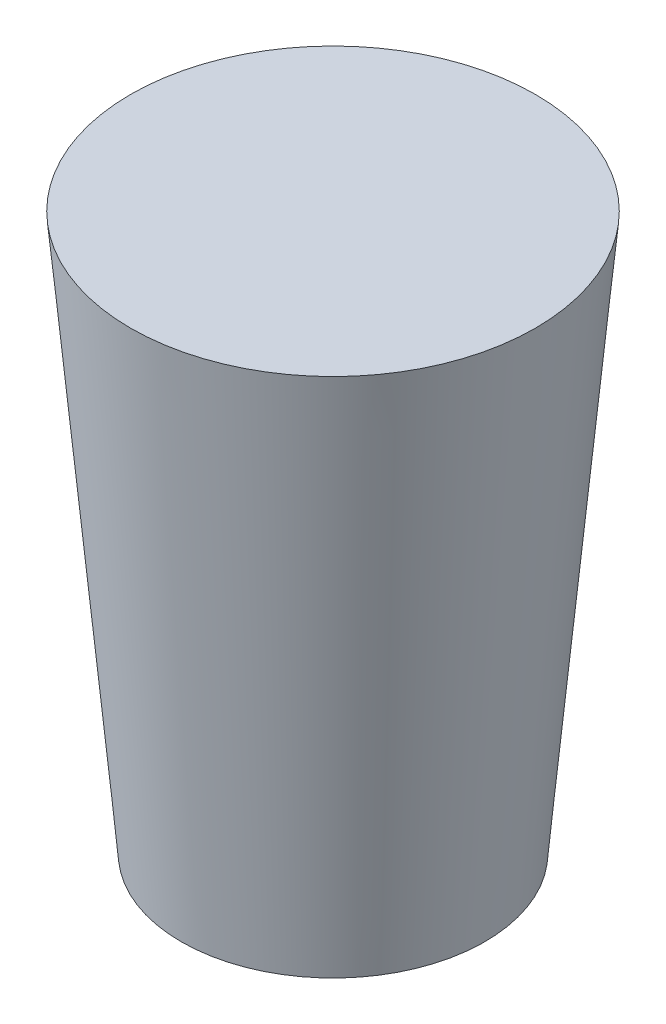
ISO-10303-21;
HEADER;
FILE_DESCRIPTION(('STEP AP214'),'2;1');
FILE_NAME('part.step','',(''),(''),'','','');
FILE_SCHEMA(('AUTOMOTIVE_DESIGN { 1 0 10303 214 1 1 1 1 }'));
ENDSEC;
DATA;
#1=APPLICATION_CONTEXT('core data for automotive mechanical design processes');
#2=APPLICATION_PROTOCOL_DEFINITION('international standard','automotive_design',2000,#1);
#3=PRODUCT_CONTEXT('',#1,'mechanical');
#4=PRODUCT('Part','Part','',(#3));
#5=PRODUCT_RELATED_PRODUCT_CATEGORY('part','',(#4));
#6=PRODUCT_DEFINITION_FORMATION('','',#4);
#7=PRODUCT_DEFINITION_CONTEXT('part definition',#1,'design');
#8=PRODUCT_DEFINITION('design','',#6,#7);
#9=PRODUCT_DEFINITION_SHAPE('','',#8);
#10=(LENGTH_UNIT() NAMED_UNIT(*) SI_UNIT(.MILLI.,.METRE.));
#11=(NAMED_UNIT(*) PLANE_ANGLE_UNIT() SI_UNIT($,.RADIAN.));
#12=(NAMED_UNIT(*) SI_UNIT($,.STERADIAN.) SOLID_ANGLE_UNIT());
#13=UNCERTAINTY_MEASURE_WITH_UNIT(LENGTH_MEASURE(1.E-05),#10,'distance_accuracy_value','');
#14=(GEOMETRIC_REPRESENTATION_CONTEXT(3) GLOBAL_UNCERTAINTY_ASSIGNED_CONTEXT((#13)) GLOBAL_UNIT_ASSIGNED_CONTEXT((#10,
#11,#12)) REPRESENTATION_CONTEXT('',''));
#15=CARTESIAN_POINT('',(0.,0.,0.));
#16=DIRECTION('',(0.,0.,1.));
#17=DIRECTION('',(1.,0.,0.));
#18=AXIS2_PLACEMENT_3D('',#15,#16,#17);
#19=CARTESIAN_POINT('',(-15.0396263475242,-25.3849168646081,0.));
#20=DIRECTION('',(0.,-1.,0.));
#21=DIRECTION('',(0.,0.,-1.));
#22=AXIS2_PLACEMENT_3D('',#19,#20,#21);
#23=PLANE('',#22);
#24=CARTESIAN_POINT('',(-15.0396263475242,-25.3849168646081,0.));
#25=DIRECTION('',(0.,1.,0.));
#26=DIRECTION('',(0.,0.,1.));
#27=AXIS2_PLACEMENT_3D('',#24,#25,#26);
#28=CIRCLE('',#27,8.99999999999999);
#29=CARTESIAN_POINT('',(-15.0396263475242,-25.3849168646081,8.99999999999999));
#30=VERTEX_POINT('',#29);
#31=EDGE_CURVE('E10',#30,#30,#28,.T.);
#32=ORIENTED_EDGE('',*,*,#31,.F.);
#33=EDGE_LOOP('',(#32));
#34=FACE_BOUND('',#33,.T.);
#35=ADVANCED_FACE('F29',(#34),#23,.T.);
#36=CARTESIAN_POINT('',(-15.0396263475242,7.61508313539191,0.));
#37=DIRECTION('',(0.,1.,0.));
#38=DIRECTION('',(0.,0.,1.));
#39=AXIS2_PLACEMENT_3D('',#36,#37,#38);
#40=CONICAL_SURFACE('',#39,12.,0.0906598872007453);
#41=ORIENTED_EDGE('',*,*,#31,.T.);
#42=EDGE_LOOP('',(#41));
#43=FACE_BOUND('',#42,.T.);
#44=CARTESIAN_POINT('',(-15.0396263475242,7.61508313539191,0.));
#45=DIRECTION('',(0.,1.,0.));
#46=DIRECTION('',(0.,0.,1.));
#47=AXIS2_PLACEMENT_3D('',#44,#45,#46);
#48=CIRCLE('',#47,12.);
#49=CARTESIAN_POINT('',(-15.0396263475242,7.61508313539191,12.));
#50=VERTEX_POINT('',#49);
#51=EDGE_CURVE('E35',#50,#50,#48,.T.);
#52=ORIENTED_EDGE('',*,*,#51,.F.);
#53=EDGE_LOOP('',(#52));
#54=FACE_BOUND('',#53,.T.);
#55=ADVANCED_FACE('F43',(#43,#54),#40,.T.);
#56=CARTESIAN_POINT('',(-27.0396263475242,7.61508313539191,0.));
#57=DIRECTION('',(0.,1.,0.));
#58=DIRECTION('',(0.,0.,1.));
#59=AXIS2_PLACEMENT_3D('',#56,#57,#58);
#60=PLANE('',#59);
#61=ORIENTED_EDGE('',*,*,#51,.T.);
#62=EDGE_LOOP('',(#61));
#63=FACE_BOUND('',#62,.T.);
#64=ADVANCED_FACE('F41',(#63),#60,.T.);
#65=CLOSED_SHELL('',(#35,#55,#64));
#66=MANIFOLD_SOLID_BREP('B2',#65);
#67=ADVANCED_BREP_SHAPE_REPRESENTATION('',(#18,#66),#14);
#68=SHAPE_DEFINITION_REPRESENTATION(#9,#67);
ENDSEC;
END-ISO-10303-21;
